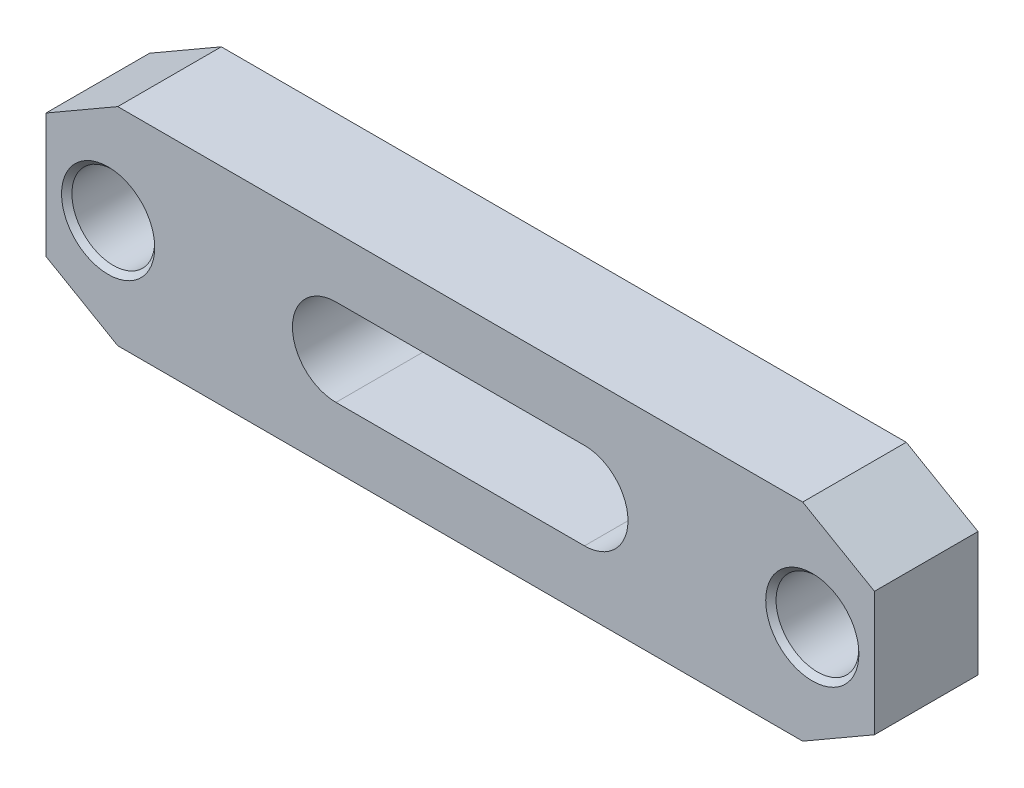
ISO-10303-21;
HEADER;
FILE_DESCRIPTION(('STEP AP214'),'2;1');
FILE_NAME('part.step','',(''),(''),'','','');
FILE_SCHEMA(('AUTOMOTIVE_DESIGN { 1 0 10303 214 1 1 1 1 }'));
ENDSEC;
DATA;
#1=APPLICATION_CONTEXT('core data for automotive mechanical design processes');
#2=APPLICATION_PROTOCOL_DEFINITION('international standard','automotive_design',2000,#1);
#3=PRODUCT_CONTEXT('',#1,'mechanical');
#4=PRODUCT('Part','Part','',(#3));
#5=PRODUCT_RELATED_PRODUCT_CATEGORY('part','',(#4));
#6=PRODUCT_DEFINITION_FORMATION('','',#4);
#7=PRODUCT_DEFINITION_CONTEXT('part definition',#1,'design');
#8=PRODUCT_DEFINITION('design','',#6,#7);
#9=PRODUCT_DEFINITION_SHAPE('','',#8);
#10=(LENGTH_UNIT() NAMED_UNIT(*) SI_UNIT(.MILLI.,.METRE.));
#11=(NAMED_UNIT(*) PLANE_ANGLE_UNIT() SI_UNIT($,.RADIAN.));
#12=(NAMED_UNIT(*) SI_UNIT($,.STERADIAN.) SOLID_ANGLE_UNIT());
#13=UNCERTAINTY_MEASURE_WITH_UNIT(LENGTH_MEASURE(1.E-05),#10,'distance_accuracy_value','');
#14=(GEOMETRIC_REPRESENTATION_CONTEXT(3) GLOBAL_UNCERTAINTY_ASSIGNED_CONTEXT((#13)) GLOBAL_UNIT_ASSIGNED_CONTEXT((#10,
#11,#12)) REPRESENTATION_CONTEXT('',''));
#15=CARTESIAN_POINT('',(0.,0.,0.));
#16=DIRECTION('',(0.,0.,1.));
#17=DIRECTION('',(1.,0.,0.));
#18=AXIS2_PLACEMENT_3D('',#15,#16,#17);
#19=CARTESIAN_POINT('',(100.,-25.,25.));
#20=DIRECTION('',(0.,0.,1.));
#21=DIRECTION('',(1.,0.,0.));
#22=AXIS2_PLACEMENT_3D('',#19,#20,#21);
#23=PLANE('',#22);
#24=CARTESIAN_POINT('',(85.,0.,25.));
#25=DIRECTION('',(0.,0.,-1.));
#26=DIRECTION('',(-1.,0.,0.));
#27=AXIS2_PLACEMENT_3D('',#24,#25,#26);
#28=CIRCLE('',#27,11.25);
#29=CARTESIAN_POINT('',(73.75,0.,25.));
#30=VERTEX_POINT('',#29);
#31=EDGE_CURVE('E212',#30,#30,#28,.T.);
#32=ORIENTED_EDGE('',*,*,#31,.T.);
#33=EDGE_LOOP('',(#32));
#34=FACE_BOUND('',#33,.T.);
#35=CARTESIAN_POINT('',(-85.,0.,25.));
#36=DIRECTION('',(0.,0.,-1.));
#37=DIRECTION('',(-1.,0.,0.));
#38=AXIS2_PLACEMENT_3D('',#35,#36,#37);
#39=CIRCLE('',#38,11.25);
#40=CARTESIAN_POINT('',(-96.25,0.,25.));
#41=VERTEX_POINT('',#40);
#42=EDGE_CURVE('E133',#41,#41,#39,.T.);
#43=ORIENTED_EDGE('',*,*,#42,.T.);
#44=EDGE_LOOP('',(#43));
#45=FACE_BOUND('',#44,.T.);
#46=DIRECTION('',(1.,0.,0.));
#47=VECTOR('',#46,1.);
#48=CARTESIAN_POINT('',(-82.6794919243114,-25.,25.));
#49=LINE('',#48,#47);
#50=CARTESIAN_POINT('',(-82.6794919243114,-25.,25.));
#51=VERTEX_POINT('',#50);
#52=CARTESIAN_POINT('',(82.6794919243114,-25.,25.));
#53=VERTEX_POINT('',#52);
#54=EDGE_CURVE('E143',#51,#53,#49,.T.);
#55=ORIENTED_EDGE('',*,*,#54,.T.);
#56=DIRECTION('',(0.866025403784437,0.5,0.));
#57=VECTOR('',#56,1.);
#58=CARTESIAN_POINT('',(82.6794919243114,-25.,25.));
#59=LINE('',#58,#57);
#60=CARTESIAN_POINT('',(100.,-15.,25.));
#61=VERTEX_POINT('',#60);
#62=EDGE_CURVE('E146',#53,#61,#59,.T.);
#63=ORIENTED_EDGE('',*,*,#62,.T.);
#64=DIRECTION('',(0.,1.,0.));
#65=VECTOR('',#64,1.);
#66=CARTESIAN_POINT('',(100.,-15.,25.));
#67=LINE('',#66,#65);
#68=CARTESIAN_POINT('',(100.,15.,25.));
#69=VERTEX_POINT('',#68);
#70=EDGE_CURVE('E149',#61,#69,#67,.T.);
#71=ORIENTED_EDGE('',*,*,#70,.T.);
#72=DIRECTION('',(-0.866025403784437,0.5,0.));
#73=VECTOR('',#72,1.);
#74=CARTESIAN_POINT('',(82.6794919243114,25.,25.));
#75=LINE('',#74,#73);
#76=CARTESIAN_POINT('',(82.6794919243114,25.,25.));
#77=VERTEX_POINT('',#76);
#78=EDGE_CURVE('E151',#69,#77,#75,.T.);
#79=ORIENTED_EDGE('',*,*,#78,.T.);
#80=DIRECTION('',(-1.,0.,0.));
#81=VECTOR('',#80,1.);
#82=CARTESIAN_POINT('',(-82.6794919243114,25.,25.));
#83=LINE('',#82,#81);
#84=CARTESIAN_POINT('',(-82.6794919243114,25.,25.));
#85=VERTEX_POINT('',#84);
#86=EDGE_CURVE('E153',#77,#85,#83,.T.);
#87=ORIENTED_EDGE('',*,*,#86,.T.);
#88=DIRECTION('',(-0.866025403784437,-0.5,0.));
#89=VECTOR('',#88,1.);
#90=CARTESIAN_POINT('',(-82.6794919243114,25.,25.));
#91=LINE('',#90,#89);
#92=CARTESIAN_POINT('',(-100.,15.,25.));
#93=VERTEX_POINT('',#92);
#94=EDGE_CURVE('E155',#85,#93,#91,.T.);
#95=ORIENTED_EDGE('',*,*,#94,.T.);
#96=DIRECTION('',(0.,-1.,0.));
#97=VECTOR('',#96,1.);
#98=CARTESIAN_POINT('',(-100.,-15.,25.));
#99=LINE('',#98,#97);
#100=CARTESIAN_POINT('',(-100.,-15.,25.));
#101=VERTEX_POINT('',#100);
#102=EDGE_CURVE('E157',#93,#101,#99,.T.);
#103=ORIENTED_EDGE('',*,*,#102,.T.);
#104=DIRECTION('',(0.866025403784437,-0.5,0.));
#105=VECTOR('',#104,1.);
#106=CARTESIAN_POINT('',(-82.6794919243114,-25.,25.));
#107=LINE('',#106,#105);
#108=EDGE_CURVE('E159',#101,#51,#107,.T.);
#109=ORIENTED_EDGE('',*,*,#108,.T.);
#110=EDGE_LOOP('',(#55,#63,#71,#79,#87,#95,#103,#109));
#111=FACE_BOUND('',#110,.T.);
#112=DIRECTION('',(-1.,0.,0.));
#113=VECTOR('',#112,1.);
#114=CARTESIAN_POINT('',(30.,10.5,25.));
#115=LINE('',#114,#113);
#116=CARTESIAN_POINT('',(30.,10.5,25.));
#117=VERTEX_POINT('',#116);
#118=CARTESIAN_POINT('',(-30.,10.5,25.));
#119=VERTEX_POINT('',#118);
#120=EDGE_CURVE('E113',#117,#119,#115,.T.);
#121=ORIENTED_EDGE('',*,*,#120,.F.);
#122=CARTESIAN_POINT('',(30.,0.,25.));
#123=DIRECTION('',(0.,0.,1.));
#124=DIRECTION('',(1.,0.,0.));
#125=AXIS2_PLACEMENT_3D('',#122,#123,#124);
#126=CIRCLE('',#125,10.5);
#127=CARTESIAN_POINT('',(30.,-10.5,25.));
#128=VERTEX_POINT('',#127);
#129=EDGE_CURVE('E105',#128,#117,#126,.T.);
#130=ORIENTED_EDGE('',*,*,#129,.F.);
#131=DIRECTION('',(1.,0.,0.));
#132=VECTOR('',#131,1.);
#133=CARTESIAN_POINT('',(30.,-10.5,25.));
#134=LINE('',#133,#132);
#135=CARTESIAN_POINT('',(-30.,-10.5,25.));
#136=VERTEX_POINT('',#135);
#137=EDGE_CURVE('E127',#136,#128,#134,.T.);
#138=ORIENTED_EDGE('',*,*,#137,.F.);
#139=CARTESIAN_POINT('',(-30.,0.,25.));
#140=DIRECTION('',(0.,0.,1.));
#141=DIRECTION('',(1.,0.,0.));
#142=AXIS2_PLACEMENT_3D('',#139,#140,#141);
#143=CIRCLE('',#142,10.5);
#144=EDGE_CURVE('E125',#119,#136,#143,.T.);
#145=ORIENTED_EDGE('',*,*,#144,.F.);
#146=EDGE_LOOP('',(#121,#130,#138,#145));
#147=FACE_BOUND('',#146,.T.);
#148=ADVANCED_FACE('F14',(#34,#45,#111,#147),#23,.T.);
#149=CARTESIAN_POINT('',(100.,-25.,0.));
#150=DIRECTION('',(0.,0.,1.));
#151=DIRECTION('',(1.,0.,0.));
#152=AXIS2_PLACEMENT_3D('',#149,#150,#151);
#153=PLANE('',#152);
#154=CARTESIAN_POINT('',(85.,0.,0.));
#155=DIRECTION('',(0.,0.,-1.));
#156=DIRECTION('',(-1.,0.,0.));
#157=AXIS2_PLACEMENT_3D('',#154,#155,#156);
#158=CIRCLE('',#157,11.25);
#159=CARTESIAN_POINT('',(73.75,0.,0.));
#160=VERTEX_POINT('',#159);
#161=EDGE_CURVE('E202',#160,#160,#158,.T.);
#162=ORIENTED_EDGE('',*,*,#161,.F.);
#163=EDGE_LOOP('',(#162));
#164=FACE_BOUND('',#163,.T.);
#165=CARTESIAN_POINT('',(-85.,0.,0.));
#166=DIRECTION('',(0.,0.,-1.));
#167=DIRECTION('',(-1.,0.,0.));
#168=AXIS2_PLACEMENT_3D('',#165,#166,#167);
#169=CIRCLE('',#168,11.25);
#170=CARTESIAN_POINT('',(-96.25,0.,0.));
#171=VERTEX_POINT('',#170);
#172=EDGE_CURVE('E215',#171,#171,#169,.T.);
#173=ORIENTED_EDGE('',*,*,#172,.F.);
#174=EDGE_LOOP('',(#173));
#175=FACE_BOUND('',#174,.T.);
#176=DIRECTION('',(1.,0.,0.));
#177=VECTOR('',#176,1.);
#178=CARTESIAN_POINT('',(-82.6794919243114,-25.,0.));
#179=LINE('',#178,#177);
#180=CARTESIAN_POINT('',(-82.6794919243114,-25.,0.));
#181=VERTEX_POINT('',#180);
#182=CARTESIAN_POINT('',(82.6794919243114,-25.,0.));
#183=VERTEX_POINT('',#182);
#184=EDGE_CURVE('E121',#181,#183,#179,.T.);
#185=ORIENTED_EDGE('',*,*,#184,.F.);
#186=DIRECTION('',(0.866025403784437,-0.5,0.));
#187=VECTOR('',#186,1.);
#188=CARTESIAN_POINT('',(-82.6794919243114,-25.,0.));
#189=LINE('',#188,#187);
#190=CARTESIAN_POINT('',(-100.,-15.,0.));
#191=VERTEX_POINT('',#190);
#192=EDGE_CURVE('E147',#191,#181,#189,.T.);
#193=ORIENTED_EDGE('',*,*,#192,.F.);
#194=DIRECTION('',(0.,-1.,0.));
#195=VECTOR('',#194,1.);
#196=CARTESIAN_POINT('',(-100.,-15.,0.));
#197=LINE('',#196,#195);
#198=CARTESIAN_POINT('',(-100.,15.,0.));
#199=VERTEX_POINT('',#198);
#200=EDGE_CURVE('E174',#199,#191,#197,.T.);
#201=ORIENTED_EDGE('',*,*,#200,.F.);
#202=DIRECTION('',(-0.866025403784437,-0.5,0.));
#203=VECTOR('',#202,1.);
#204=CARTESIAN_POINT('',(-82.6794919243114,25.,0.));
#205=LINE('',#204,#203);
#206=CARTESIAN_POINT('',(-82.6794919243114,25.,0.));
#207=VERTEX_POINT('',#206);
#208=EDGE_CURVE('E172',#207,#199,#205,.T.);
#209=ORIENTED_EDGE('',*,*,#208,.F.);
#210=DIRECTION('',(-1.,0.,0.));
#211=VECTOR('',#210,1.);
#212=CARTESIAN_POINT('',(-82.6794919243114,25.,0.));
#213=LINE('',#212,#211);
#214=CARTESIAN_POINT('',(82.6794919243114,25.,0.));
#215=VERTEX_POINT('',#214);
#216=EDGE_CURVE('E170',#215,#207,#213,.T.);
#217=ORIENTED_EDGE('',*,*,#216,.F.);
#218=DIRECTION('',(-0.866025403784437,0.5,0.));
#219=VECTOR('',#218,1.);
#220=CARTESIAN_POINT('',(82.6794919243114,25.,0.));
#221=LINE('',#220,#219);
#222=CARTESIAN_POINT('',(100.,15.,0.));
#223=VERTEX_POINT('',#222);
#224=EDGE_CURVE('E168',#223,#215,#221,.T.);
#225=ORIENTED_EDGE('',*,*,#224,.F.);
#226=DIRECTION('',(0.,1.,0.));
#227=VECTOR('',#226,1.);
#228=CARTESIAN_POINT('',(100.,-15.,0.));
#229=LINE('',#228,#227);
#230=CARTESIAN_POINT('',(100.,-15.,0.));
#231=VERTEX_POINT('',#230);
#232=EDGE_CURVE('E166',#231,#223,#229,.T.);
#233=ORIENTED_EDGE('',*,*,#232,.F.);
#234=DIRECTION('',(0.866025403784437,0.5,0.));
#235=VECTOR('',#234,1.);
#236=CARTESIAN_POINT('',(82.6794919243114,-25.,0.));
#237=LINE('',#236,#235);
#238=EDGE_CURVE('E164',#183,#231,#237,.T.);
#239=ORIENTED_EDGE('',*,*,#238,.F.);
#240=EDGE_LOOP('',(#185,#193,#201,#209,#217,#225,#233,#239));
#241=FACE_BOUND('',#240,.T.);
#242=CARTESIAN_POINT('',(30.,0.,0.));
#243=DIRECTION('',(0.,0.,1.));
#244=DIRECTION('',(1.,0.,0.));
#245=AXIS2_PLACEMENT_3D('',#242,#243,#244);
#246=CIRCLE('',#245,10.5);
#247=CARTESIAN_POINT('',(30.,-10.5,0.));
#248=VERTEX_POINT('',#247);
#249=CARTESIAN_POINT('',(30.,10.5,0.));
#250=VERTEX_POINT('',#249);
#251=EDGE_CURVE('E39',#248,#250,#246,.T.);
#252=ORIENTED_EDGE('',*,*,#251,.T.);
#253=DIRECTION('',(-1.,0.,0.));
#254=VECTOR('',#253,1.);
#255=CARTESIAN_POINT('',(30.,10.5,0.));
#256=LINE('',#255,#254);
#257=CARTESIAN_POINT('',(-30.,10.5,0.));
#258=VERTEX_POINT('',#257);
#259=EDGE_CURVE('E120',#250,#258,#256,.T.);
#260=ORIENTED_EDGE('',*,*,#259,.T.);
#261=CARTESIAN_POINT('',(-30.,0.,0.));
#262=DIRECTION('',(0.,0.,1.));
#263=DIRECTION('',(1.,0.,0.));
#264=AXIS2_PLACEMENT_3D('',#261,#262,#263);
#265=CIRCLE('',#264,10.5);
#266=CARTESIAN_POINT('',(-30.,-10.5,0.));
#267=VERTEX_POINT('',#266);
#268=EDGE_CURVE('E135',#258,#267,#265,.T.);
#269=ORIENTED_EDGE('',*,*,#268,.T.);
#270=DIRECTION('',(1.,0.,0.));
#271=VECTOR('',#270,1.);
#272=CARTESIAN_POINT('',(30.,-10.5,0.));
#273=LINE('',#272,#271);
#274=EDGE_CURVE('E114',#267,#248,#273,.T.);
#275=ORIENTED_EDGE('',*,*,#274,.T.);
#276=EDGE_LOOP('',(#252,#260,#269,#275));
#277=FACE_BOUND('',#276,.T.);
#278=ADVANCED_FACE('F238',(#164,#175,#241,#277),#153,.F.);
#279=CARTESIAN_POINT('',(-82.6794919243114,-25.,25.));
#280=DIRECTION('',(0.,1.,0.));
#281=DIRECTION('',(-1.,0.,0.));
#282=AXIS2_PLACEMENT_3D('',#279,#280,#281);
#283=PLANE('',#282);
#284=ORIENTED_EDGE('',*,*,#184,.T.);
#285=DIRECTION('',(0.,0.,-1.));
#286=VECTOR('',#285,1.);
#287=CARTESIAN_POINT('',(82.6794919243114,-25.,25.));
#288=LINE('',#287,#286);
#289=EDGE_CURVE('E9',#53,#183,#288,.T.);
#290=ORIENTED_EDGE('',*,*,#289,.F.);
#291=ORIENTED_EDGE('',*,*,#54,.F.);
#292=DIRECTION('',(0.,0.,-1.));
#293=VECTOR('',#292,1.);
#294=CARTESIAN_POINT('',(-82.6794919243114,-25.,25.));
#295=LINE('',#294,#293);
#296=EDGE_CURVE('E161',#51,#181,#295,.T.);
#297=ORIENTED_EDGE('',*,*,#296,.T.);
#298=EDGE_LOOP('',(#284,#290,#291,#297));
#299=FACE_BOUND('',#298,.T.);
#300=ADVANCED_FACE('F16',(#299),#283,.F.);
#301=CARTESIAN_POINT('',(82.6794919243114,-25.,25.));
#302=DIRECTION('',(-0.5,0.866025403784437,0.));
#303=DIRECTION('',(-0.866025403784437,-0.5,0.));
#304=AXIS2_PLACEMENT_3D('',#301,#302,#303);
#305=PLANE('',#304);
#306=ORIENTED_EDGE('',*,*,#238,.T.);
#307=DIRECTION('',(0.,0.,-1.));
#308=VECTOR('',#307,1.);
#309=CARTESIAN_POINT('',(100.,-15.,25.));
#310=LINE('',#309,#308);
#311=EDGE_CURVE('E23',#61,#231,#310,.T.);
#312=ORIENTED_EDGE('',*,*,#311,.F.);
#313=ORIENTED_EDGE('',*,*,#62,.F.);
#314=ORIENTED_EDGE('',*,*,#289,.T.);
#315=EDGE_LOOP('',(#306,#312,#313,#314));
#316=FACE_BOUND('',#315,.T.);
#317=ADVANCED_FACE('F271',(#316),#305,.F.);
#318=CARTESIAN_POINT('',(100.,-15.,25.));
#319=DIRECTION('',(-1.,0.,0.));
#320=DIRECTION('',(0.,0.,1.));
#321=AXIS2_PLACEMENT_3D('',#318,#319,#320);
#322=PLANE('',#321);
#323=ORIENTED_EDGE('',*,*,#232,.T.);
#324=DIRECTION('',(0.,0.,-1.));
#325=VECTOR('',#324,1.);
#326=CARTESIAN_POINT('',(100.,15.,25.));
#327=LINE('',#326,#325);
#328=EDGE_CURVE('E191',#69,#223,#327,.T.);
#329=ORIENTED_EDGE('',*,*,#328,.F.);
#330=ORIENTED_EDGE('',*,*,#70,.F.);
#331=ORIENTED_EDGE('',*,*,#311,.T.);
#332=EDGE_LOOP('',(#323,#329,#330,#331));
#333=FACE_BOUND('',#332,.T.);
#334=ADVANCED_FACE('F268',(#333),#322,.F.);
#335=CARTESIAN_POINT('',(82.6794919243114,25.,25.));
#336=DIRECTION('',(-0.5,-0.866025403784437,0.));
#337=DIRECTION('',(0.866025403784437,-0.5,0.));
#338=AXIS2_PLACEMENT_3D('',#335,#336,#337);
#339=PLANE('',#338);
#340=ORIENTED_EDGE('',*,*,#224,.T.);
#341=DIRECTION('',(0.,0.,-1.));
#342=VECTOR('',#341,1.);
#343=CARTESIAN_POINT('',(82.6794919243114,25.,25.));
#344=LINE('',#343,#342);
#345=EDGE_CURVE('E188',#77,#215,#344,.T.);
#346=ORIENTED_EDGE('',*,*,#345,.F.);
#347=ORIENTED_EDGE('',*,*,#78,.F.);
#348=ORIENTED_EDGE('',*,*,#328,.T.);
#349=EDGE_LOOP('',(#340,#346,#347,#348));
#350=FACE_BOUND('',#349,.T.);
#351=ADVANCED_FACE('F264',(#350),#339,.F.);
#352=CARTESIAN_POINT('',(-82.6794919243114,25.,25.));
#353=DIRECTION('',(0.,-1.,0.));
#354=DIRECTION('',(0.,0.,-1.));
#355=AXIS2_PLACEMENT_3D('',#352,#353,#354);
#356=PLANE('',#355);
#357=ORIENTED_EDGE('',*,*,#216,.T.);
#358=DIRECTION('',(0.,0.,-1.));
#359=VECTOR('',#358,1.);
#360=CARTESIAN_POINT('',(-82.6794919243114,25.,25.));
#361=LINE('',#360,#359);
#362=EDGE_CURVE('E185',#85,#207,#361,.T.);
#363=ORIENTED_EDGE('',*,*,#362,.F.);
#364=ORIENTED_EDGE('',*,*,#86,.F.);
#365=ORIENTED_EDGE('',*,*,#345,.T.);
#366=EDGE_LOOP('',(#357,#363,#364,#365));
#367=FACE_BOUND('',#366,.T.);
#368=ADVANCED_FACE('F260',(#367),#356,.F.);
#369=CARTESIAN_POINT('',(-82.6794919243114,25.,25.));
#370=DIRECTION('',(0.5,-0.866025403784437,0.));
#371=DIRECTION('',(0.866025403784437,0.5,0.));
#372=AXIS2_PLACEMENT_3D('',#369,#370,#371);
#373=PLANE('',#372);
#374=ORIENTED_EDGE('',*,*,#208,.T.);
#375=DIRECTION('',(0.,0.,-1.));
#376=VECTOR('',#375,1.);
#377=CARTESIAN_POINT('',(-100.,15.,25.));
#378=LINE('',#377,#376);
#379=EDGE_CURVE('E182',#93,#199,#378,.T.);
#380=ORIENTED_EDGE('',*,*,#379,.F.);
#381=ORIENTED_EDGE('',*,*,#94,.F.);
#382=ORIENTED_EDGE('',*,*,#362,.T.);
#383=EDGE_LOOP('',(#374,#380,#381,#382));
#384=FACE_BOUND('',#383,.T.);
#385=ADVANCED_FACE('F256',(#384),#373,.F.);
#386=CARTESIAN_POINT('',(-100.,-15.,25.));
#387=DIRECTION('',(1.,0.,0.));
#388=DIRECTION('',(0.,0.,-1.));
#389=AXIS2_PLACEMENT_3D('',#386,#387,#388);
#390=PLANE('',#389);
#391=ORIENTED_EDGE('',*,*,#200,.T.);
#392=DIRECTION('',(0.,0.,-1.));
#393=VECTOR('',#392,1.);
#394=CARTESIAN_POINT('',(-100.,-15.,25.));
#395=LINE('',#394,#393);
#396=EDGE_CURVE('E179',#101,#191,#395,.T.);
#397=ORIENTED_EDGE('',*,*,#396,.F.);
#398=ORIENTED_EDGE('',*,*,#102,.F.);
#399=ORIENTED_EDGE('',*,*,#379,.T.);
#400=EDGE_LOOP('',(#391,#397,#398,#399));
#401=FACE_BOUND('',#400,.T.);
#402=ADVANCED_FACE('F252',(#401),#390,.F.);
#403=CARTESIAN_POINT('',(-82.6794919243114,-25.,25.));
#404=DIRECTION('',(0.5,0.866025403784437,0.));
#405=DIRECTION('',(-0.866025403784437,0.5,0.));
#406=AXIS2_PLACEMENT_3D('',#403,#404,#405);
#407=PLANE('',#406);
#408=ORIENTED_EDGE('',*,*,#192,.T.);
#409=ORIENTED_EDGE('',*,*,#296,.F.);
#410=ORIENTED_EDGE('',*,*,#108,.F.);
#411=ORIENTED_EDGE('',*,*,#396,.T.);
#412=EDGE_LOOP('',(#408,#409,#410,#411));
#413=FACE_BOUND('',#412,.T.);
#414=ADVANCED_FACE('F249',(#413),#407,.F.);
#415=CARTESIAN_POINT('',(30.,0.,25.));
#416=DIRECTION('',(0.,0.,-1.));
#417=DIRECTION('',(-1.,0.,0.));
#418=AXIS2_PLACEMENT_3D('',#415,#416,#417);
#419=CYLINDRICAL_SURFACE('',#418,10.5);
#420=ORIENTED_EDGE('',*,*,#251,.F.);
#421=DIRECTION('',(0.,0.,-1.));
#422=VECTOR('',#421,1.);
#423=CARTESIAN_POINT('',(30.,-10.5,25.));
#424=LINE('',#423,#422);
#425=EDGE_CURVE('E109',#128,#248,#424,.T.);
#426=ORIENTED_EDGE('',*,*,#425,.F.);
#427=ORIENTED_EDGE('',*,*,#129,.T.);
#428=DIRECTION('',(0.,0.,-1.));
#429=VECTOR('',#428,1.);
#430=CARTESIAN_POINT('',(30.,10.5,25.));
#431=LINE('',#430,#429);
#432=EDGE_CURVE('E108',#117,#250,#431,.T.);
#433=ORIENTED_EDGE('',*,*,#432,.T.);
#434=EDGE_LOOP('',(#420,#426,#427,#433));
#435=FACE_BOUND('',#434,.T.);
#436=ADVANCED_FACE('F107',(#435),#419,.F.);
#437=CARTESIAN_POINT('',(30.,10.5,25.));
#438=DIRECTION('',(0.,-1.,0.));
#439=DIRECTION('',(1.,0.,0.));
#440=AXIS2_PLACEMENT_3D('',#437,#438,#439);
#441=PLANE('',#440);
#442=ORIENTED_EDGE('',*,*,#259,.F.);
#443=ORIENTED_EDGE('',*,*,#432,.F.);
#444=ORIENTED_EDGE('',*,*,#120,.T.);
#445=DIRECTION('',(0.,0.,-1.));
#446=VECTOR('',#445,1.);
#447=CARTESIAN_POINT('',(-30.,10.5,25.));
#448=LINE('',#447,#446);
#449=EDGE_CURVE('E122',#119,#258,#448,.T.);
#450=ORIENTED_EDGE('',*,*,#449,.T.);
#451=EDGE_LOOP('',(#442,#443,#444,#450));
#452=FACE_BOUND('',#451,.T.);
#453=ADVANCED_FACE('F117',(#452),#441,.T.);
#454=CARTESIAN_POINT('',(-30.,0.,25.));
#455=DIRECTION('',(0.,0.,-1.));
#456=DIRECTION('',(-1.,0.,0.));
#457=AXIS2_PLACEMENT_3D('',#454,#455,#456);
#458=CYLINDRICAL_SURFACE('',#457,10.5);
#459=ORIENTED_EDGE('',*,*,#268,.F.);
#460=ORIENTED_EDGE('',*,*,#449,.F.);
#461=ORIENTED_EDGE('',*,*,#144,.T.);
#462=DIRECTION('',(0.,0.,-1.));
#463=VECTOR('',#462,1.);
#464=CARTESIAN_POINT('',(-30.,-10.5,25.));
#465=LINE('',#464,#463);
#466=EDGE_CURVE('E31',#136,#267,#465,.T.);
#467=ORIENTED_EDGE('',*,*,#466,.T.);
#468=EDGE_LOOP('',(#459,#460,#461,#467));
#469=FACE_BOUND('',#468,.T.);
#470=ADVANCED_FACE('F235',(#469),#458,.F.);
#471=CARTESIAN_POINT('',(30.,-10.5,25.));
#472=DIRECTION('',(0.,1.,0.));
#473=DIRECTION('',(-1.,0.,0.));
#474=AXIS2_PLACEMENT_3D('',#471,#472,#473);
#475=PLANE('',#474);
#476=ORIENTED_EDGE('',*,*,#274,.F.);
#477=ORIENTED_EDGE('',*,*,#466,.F.);
#478=ORIENTED_EDGE('',*,*,#137,.T.);
#479=ORIENTED_EDGE('',*,*,#425,.T.);
#480=EDGE_LOOP('',(#476,#477,#478,#479));
#481=FACE_BOUND('',#480,.T.);
#482=ADVANCED_FACE('F225',(#481),#475,.T.);
#483=CARTESIAN_POINT('',(-85.,0.,22.5));
#484=DIRECTION('',(0.,0.,1.));
#485=DIRECTION('',(1.,0.,0.));
#486=AXIS2_PLACEMENT_3D('',#483,#484,#485);
#487=CONICAL_SURFACE('',#486,8.75,0.785398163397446);
#488=CARTESIAN_POINT('',(-85.,0.,23.75));
#489=DIRECTION('',(0.,0.,1.));
#490=DIRECTION('',(1.,0.,0.));
#491=AXIS2_PLACEMENT_3D('',#488,#489,#490);
#492=CIRCLE('',#491,10.);
#493=CARTESIAN_POINT('',(-75.,0.,23.75));
#494=VERTEX_POINT('',#493);
#495=EDGE_CURVE('E197',#494,#494,#492,.F.);
#496=ORIENTED_EDGE('',*,*,#495,.T.);
#497=EDGE_LOOP('',(#496));
#498=FACE_BOUND('',#497,.T.);
#499=ORIENTED_EDGE('',*,*,#42,.F.);
#500=EDGE_LOOP('',(#499));
#501=FACE_BOUND('',#500,.T.);
#502=ADVANCED_FACE('F222',(#498,#501),#487,.F.);
#503=CARTESIAN_POINT('',(-85.,0.,0.));
#504=DIRECTION('',(0.,0.,-1.));
#505=DIRECTION('',(-1.,0.,0.));
#506=AXIS2_PLACEMENT_3D('',#503,#504,#505);
#507=CONICAL_SURFACE('',#506,11.25,0.785398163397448);
#508=CARTESIAN_POINT('',(-85.,0.,1.25));
#509=DIRECTION('',(0.,0.,-1.));
#510=DIRECTION('',(-1.,0.,0.));
#511=AXIS2_PLACEMENT_3D('',#508,#509,#510);
#512=CIRCLE('',#511,10.);
#513=CARTESIAN_POINT('',(-95.,0.,1.25));
#514=VERTEX_POINT('',#513);
#515=EDGE_CURVE('E195',#514,#514,#512,.F.);
#516=ORIENTED_EDGE('',*,*,#515,.T.);
#517=EDGE_LOOP('',(#516));
#518=FACE_BOUND('',#517,.T.);
#519=ORIENTED_EDGE('',*,*,#172,.T.);
#520=EDGE_LOOP('',(#519));
#521=FACE_BOUND('',#520,.T.);
#522=ADVANCED_FACE('F224',(#518,#521),#507,.F.);
#523=CARTESIAN_POINT('',(85.,0.,22.5));
#524=DIRECTION('',(0.,0.,1.));
#525=DIRECTION('',(1.,0.,0.));
#526=AXIS2_PLACEMENT_3D('',#523,#524,#525);
#527=CONICAL_SURFACE('',#526,8.75,0.785398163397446);
#528=CARTESIAN_POINT('',(85.,0.,23.75));
#529=DIRECTION('',(0.,0.,1.));
#530=DIRECTION('',(1.,0.,0.));
#531=AXIS2_PLACEMENT_3D('',#528,#529,#530);
#532=CIRCLE('',#531,10.);
#533=CARTESIAN_POINT('',(95.,0.,23.75));
#534=VERTEX_POINT('',#533);
#535=EDGE_CURVE('E198',#534,#534,#532,.F.);
#536=ORIENTED_EDGE('',*,*,#535,.T.);
#537=EDGE_LOOP('',(#536));
#538=FACE_BOUND('',#537,.T.);
#539=ORIENTED_EDGE('',*,*,#31,.F.);
#540=EDGE_LOOP('',(#539));
#541=FACE_BOUND('',#540,.T.);
#542=ADVANCED_FACE('F233',(#538,#541),#527,.F.);
#543=CARTESIAN_POINT('',(85.,0.,0.));
#544=DIRECTION('',(0.,0.,-1.));
#545=DIRECTION('',(-1.,0.,0.));
#546=AXIS2_PLACEMENT_3D('',#543,#544,#545);
#547=CONICAL_SURFACE('',#546,11.25,0.785398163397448);
#548=CARTESIAN_POINT('',(85.,0.,1.25));
#549=DIRECTION('',(0.,0.,-1.));
#550=DIRECTION('',(-1.,0.,0.));
#551=AXIS2_PLACEMENT_3D('',#548,#549,#550);
#552=CIRCLE('',#551,10.);
#553=CARTESIAN_POINT('',(75.,0.,1.25));
#554=VERTEX_POINT('',#553);
#555=EDGE_CURVE('E18',#554,#554,#552,.F.);
#556=ORIENTED_EDGE('',*,*,#555,.T.);
#557=EDGE_LOOP('',(#556));
#558=FACE_BOUND('',#557,.T.);
#559=ORIENTED_EDGE('',*,*,#161,.T.);
#560=EDGE_LOOP('',(#559));
#561=FACE_BOUND('',#560,.T.);
#562=ADVANCED_FACE('F398',(#558,#561),#547,.F.);
#563=CARTESIAN_POINT('',(-85.,0.,0.));
#564=DIRECTION('',(0.,0.,1.));
#565=DIRECTION('',(1.,0.,0.));
#566=AXIS2_PLACEMENT_3D('',#563,#564,#565);
#567=CYLINDRICAL_SURFACE('',#566,10.);
#568=ORIENTED_EDGE('',*,*,#515,.F.);
#569=EDGE_LOOP('',(#568));
#570=FACE_BOUND('',#569,.T.);
#571=ORIENTED_EDGE('',*,*,#495,.F.);
#572=EDGE_LOOP('',(#571));
#573=FACE_BOUND('',#572,.T.);
#574=ADVANCED_FACE('F407',(#570,#573),#567,.F.);
#575=CARTESIAN_POINT('',(85.,0.,0.));
#576=DIRECTION('',(0.,0.,1.));
#577=DIRECTION('',(1.,0.,0.));
#578=AXIS2_PLACEMENT_3D('',#575,#576,#577);
#579=CYLINDRICAL_SURFACE('',#578,10.);
#580=ORIENTED_EDGE('',*,*,#555,.F.);
#581=EDGE_LOOP('',(#580));
#582=FACE_BOUND('',#581,.T.);
#583=ORIENTED_EDGE('',*,*,#535,.F.);
#584=EDGE_LOOP('',(#583));
#585=FACE_BOUND('',#584,.T.);
#586=ADVANCED_FACE('F417',(#582,#585),#579,.F.);
#587=CLOSED_SHELL('',(#148,#278,#300,#317,#334,#351,#368,#385,#402,#414,#436,#453,#470,#482,
#502,#522,#542,#562,#574,#586));
#588=MANIFOLD_SOLID_BREP('B1',#587);
#589=ADVANCED_BREP_SHAPE_REPRESENTATION('',(#18,#588),#14);
#590=SHAPE_DEFINITION_REPRESENTATION(#9,#589);
ENDSEC;
END-ISO-10303-21;
